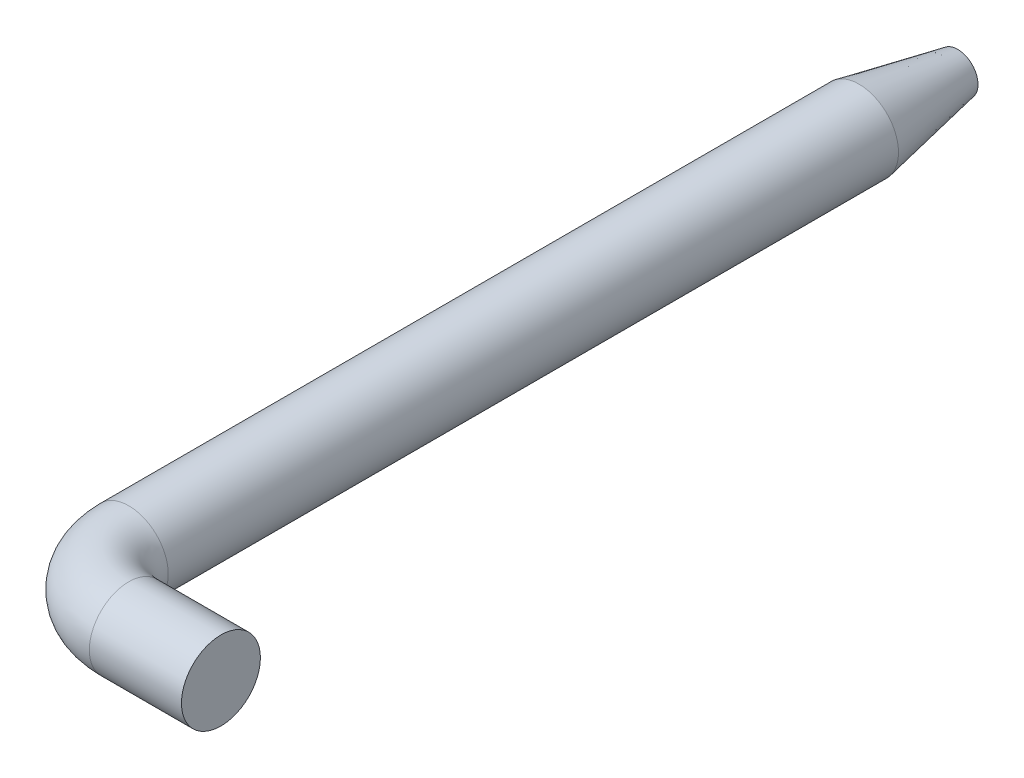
ISO-10303-21;
HEADER;
FILE_DESCRIPTION(('STEP AP214'),'2;1');
FILE_NAME('part.step','',(''),(''),'','','');
FILE_SCHEMA(('AUTOMOTIVE_DESIGN { 1 0 10303 214 1 1 1 1 }'));
ENDSEC;
DATA;
#1=APPLICATION_CONTEXT('core data for automotive mechanical design processes');
#2=APPLICATION_PROTOCOL_DEFINITION('international standard','automotive_design',2000,#1);
#3=PRODUCT_CONTEXT('',#1,'mechanical');
#4=PRODUCT('Part','Part','',(#3));
#5=PRODUCT_RELATED_PRODUCT_CATEGORY('part','',(#4));
#6=PRODUCT_DEFINITION_FORMATION('','',#4);
#7=PRODUCT_DEFINITION_CONTEXT('part definition',#1,'design');
#8=PRODUCT_DEFINITION('design','',#6,#7);
#9=PRODUCT_DEFINITION_SHAPE('','',#8);
#10=(LENGTH_UNIT() NAMED_UNIT(*) SI_UNIT(.MILLI.,.METRE.));
#11=(NAMED_UNIT(*) PLANE_ANGLE_UNIT() SI_UNIT($,.RADIAN.));
#12=(NAMED_UNIT(*) SI_UNIT($,.STERADIAN.) SOLID_ANGLE_UNIT());
#13=UNCERTAINTY_MEASURE_WITH_UNIT(LENGTH_MEASURE(1.E-05),#10,'distance_accuracy_value','');
#14=(GEOMETRIC_REPRESENTATION_CONTEXT(3) GLOBAL_UNCERTAINTY_ASSIGNED_CONTEXT((#13)) GLOBAL_UNIT_ASSIGNED_CONTEXT((#10,
#11,#12)) REPRESENTATION_CONTEXT('',''));
#15=CARTESIAN_POINT('',(0.,0.,0.));
#16=DIRECTION('',(0.,0.,1.));
#17=DIRECTION('',(1.,0.,0.));
#18=AXIS2_PLACEMENT_3D('',#15,#16,#17);
#19=CARTESIAN_POINT('',(0.,0.,63.));
#20=DIRECTION('',(0.,0.,-1.));
#21=DIRECTION('',(0.,-1.,0.));
#22=AXIS2_PLACEMENT_3D('',#19,#20,#21);
#23=CYLINDRICAL_SURFACE('',#22,3.);
#24=CARTESIAN_POINT('',(0.,0.,63.));
#25=DIRECTION('',(0.,0.,1.));
#26=DIRECTION('',(0.,1.,0.));
#27=AXIS2_PLACEMENT_3D('',#24,#25,#26);
#28=CIRCLE('',#27,3.);
#29=CARTESIAN_POINT('',(-3.,0.,63.));
#30=VERTEX_POINT('',#29);
#31=EDGE_CURVE('E23',#30,#30,#28,.T.);
#32=ORIENTED_EDGE('',*,*,#31,.F.);
#33=EDGE_LOOP('',(#32));
#34=FACE_BOUND('',#33,.T.);
#35=CARTESIAN_POINT('',(0.,0.,7.5));
#36=DIRECTION('',(0.,0.,1.));
#37=DIRECTION('',(0.,1.,0.));
#38=AXIS2_PLACEMENT_3D('',#35,#36,#37);
#39=CIRCLE('',#38,3.);
#40=CARTESIAN_POINT('',(0.,3.,7.5));
#41=VERTEX_POINT('',#40);
#42=EDGE_CURVE('E27',#41,#41,#39,.T.);
#43=ORIENTED_EDGE('',*,*,#42,.T.);
#44=EDGE_LOOP('',(#43));
#45=FACE_BOUND('',#44,.T.);
#46=ADVANCED_FACE('F12',(#34,#45),#23,.T.);
#47=CARTESIAN_POINT('',(5.,0.,68.));
#48=DIRECTION('',(1.,0.,0.));
#49=DIRECTION('',(0.,1.,0.));
#50=AXIS2_PLACEMENT_3D('',#47,#48,#49);
#51=CYLINDRICAL_SURFACE('',#50,3.);
#52=CARTESIAN_POINT('',(5.,0.,68.));
#53=DIRECTION('',(1.,0.,0.));
#54=DIRECTION('',(0.,1.,0.));
#55=AXIS2_PLACEMENT_3D('',#52,#53,#54);
#56=CIRCLE('',#55,3.);
#57=CARTESIAN_POINT('',(5.,0.,71.));
#58=VERTEX_POINT('',#57);
#59=EDGE_CURVE('E19',#58,#58,#56,.T.);
#60=ORIENTED_EDGE('',*,*,#59,.T.);
#61=EDGE_LOOP('',(#60));
#62=FACE_BOUND('',#61,.T.);
#63=CARTESIAN_POINT('',(12.,0.,68.));
#64=DIRECTION('',(1.,0.,0.));
#65=DIRECTION('',(0.,1.,0.));
#66=AXIS2_PLACEMENT_3D('',#63,#64,#65);
#67=CIRCLE('',#66,3.);
#68=CARTESIAN_POINT('',(12.,3.,68.));
#69=VERTEX_POINT('',#68);
#70=EDGE_CURVE('E8',#69,#69,#67,.T.);
#71=ORIENTED_EDGE('',*,*,#70,.F.);
#72=EDGE_LOOP('',(#71));
#73=FACE_BOUND('',#72,.T.);
#74=ADVANCED_FACE('F14',(#62,#73),#51,.T.);
#75=CARTESIAN_POINT('',(5.,0.,63.));
#76=DIRECTION('',(0.,1.,0.));
#77=DIRECTION('',(-1.,0.,0.));
#78=AXIS2_PLACEMENT_3D('',#75,#76,#77);
#79=TOROIDAL_SURFACE('',#78,5.,3.);
#80=CARTESIAN_POINT('',(5.,0.,63.));
#81=DIRECTION('',(0.,1.,0.));
#82=DIRECTION('',(-1.,0.,0.));
#83=AXIS2_PLACEMENT_3D('',#80,#81,#82);
#84=CIRCLE('',#83,8.);
#85=EDGE_CURVE('',#30,#58,#84,.T.);
#86=ORIENTED_EDGE('',*,*,#31,.T.);
#87=ORIENTED_EDGE('',*,*,#59,.F.);
#88=ORIENTED_EDGE('',*,*,#85,.T.);
#89=ORIENTED_EDGE('',*,*,#85,.F.);
#90=EDGE_LOOP('',(#86,#88,#87,#89));
#91=FACE_BOUND('',#90,.T.);
#92=ADVANCED_FACE('F55',(#91),#79,.T.);
#93=CARTESIAN_POINT('',(12.,0.,68.));
#94=DIRECTION('',(1.,0.,0.));
#95=DIRECTION('',(0.,1.,0.));
#96=AXIS2_PLACEMENT_3D('',#93,#94,#95);
#97=PLANE('',#96);
#98=ORIENTED_EDGE('',*,*,#70,.T.);
#99=EDGE_LOOP('',(#98));
#100=FACE_BOUND('',#99,.T.);
#101=ADVANCED_FACE('F46',(#100),#97,.T.);
#102=CARTESIAN_POINT('',(0.,0.,7.5));
#103=DIRECTION('',(0.,0.,1.));
#104=DIRECTION('',(0.,1.,0.));
#105=AXIS2_PLACEMENT_3D('',#102,#103,#104);
#106=CONICAL_SURFACE('',#105,3.,0.19198621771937);
#107=CARTESIAN_POINT('',(0.,0.,0.));
#108=DIRECTION('',(0.,0.,1.));
#109=DIRECTION('',(0.,1.,0.));
#110=AXIS2_PLACEMENT_3D('',#107,#108,#109);
#111=CIRCLE('',#110,1.54214768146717);
#112=CARTESIAN_POINT('',(0.,1.54214768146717,0.));
#113=VERTEX_POINT('',#112);
#114=EDGE_CURVE('E32',#113,#113,#111,.T.);
#115=ORIENTED_EDGE('',*,*,#114,.T.);
#116=EDGE_LOOP('',(#115));
#117=FACE_BOUND('',#116,.T.);
#118=ORIENTED_EDGE('',*,*,#42,.F.);
#119=EDGE_LOOP('',(#118));
#120=FACE_BOUND('',#119,.T.);
#121=ADVANCED_FACE('F36',(#117,#120),#106,.T.);
#122=CARTESIAN_POINT('',(0.,0.,0.));
#123=DIRECTION('',(0.,0.,1.));
#124=DIRECTION('',(0.,1.,0.));
#125=AXIS2_PLACEMENT_3D('',#122,#123,#124);
#126=PLANE('',#125);
#127=ORIENTED_EDGE('',*,*,#114,.F.);
#128=EDGE_LOOP('',(#127));
#129=FACE_BOUND('',#128,.T.);
#130=ADVANCED_FACE('F39',(#129),#126,.F.);
#131=CLOSED_SHELL('',(#46,#74,#92,#101,#121,#130));
#132=MANIFOLD_SOLID_BREP('B1',#131);
#133=ADVANCED_BREP_SHAPE_REPRESENTATION('',(#18,#132),#14);
#134=SHAPE_DEFINITION_REPRESENTATION(#9,#133);
ENDSEC;
END-ISO-10303-21;
